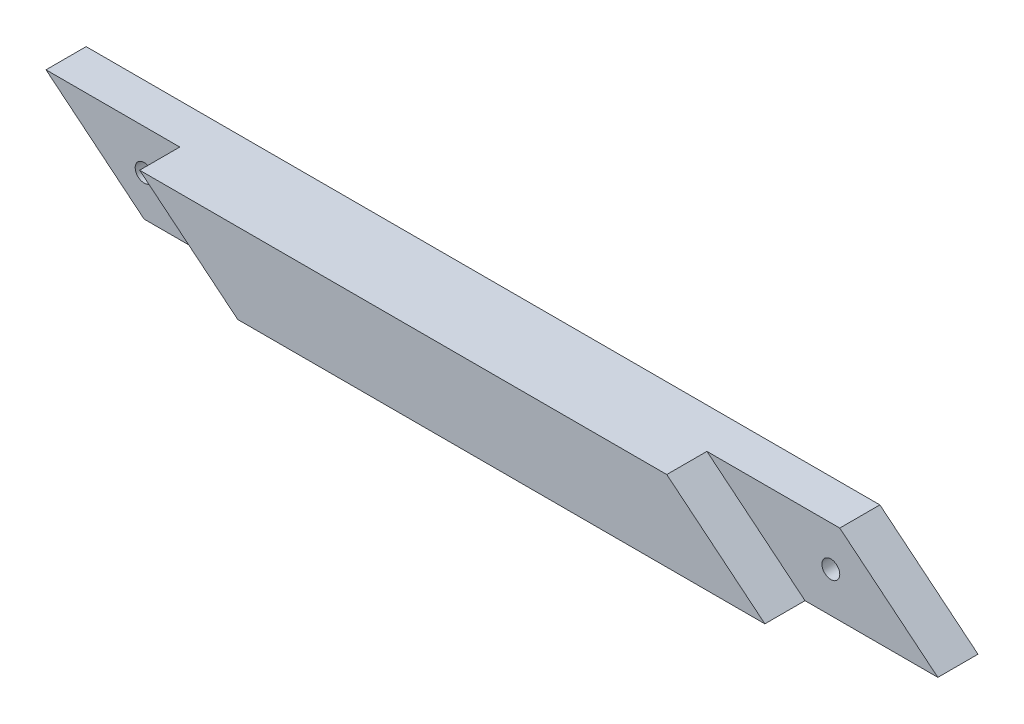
ISO-10303-21;
HEADER;
FILE_DESCRIPTION(('STEP AP214'),'2;1');
FILE_NAME('part.step','',(''),(''),'','','');
FILE_SCHEMA(('AUTOMOTIVE_DESIGN { 1 0 10303 214 1 1 1 1 }'));
ENDSEC;
DATA;
#1=APPLICATION_CONTEXT('core data for automotive mechanical design processes');
#2=APPLICATION_PROTOCOL_DEFINITION('international standard','automotive_design',2000,#1);
#3=PRODUCT_CONTEXT('',#1,'mechanical');
#4=PRODUCT('Part','Part','',(#3));
#5=PRODUCT_RELATED_PRODUCT_CATEGORY('part','',(#4));
#6=PRODUCT_DEFINITION_FORMATION('','',#4);
#7=PRODUCT_DEFINITION_CONTEXT('part definition',#1,'design');
#8=PRODUCT_DEFINITION('design','',#6,#7);
#9=PRODUCT_DEFINITION_SHAPE('','',#8);
#10=(LENGTH_UNIT() NAMED_UNIT(*) SI_UNIT(.MILLI.,.METRE.));
#11=(NAMED_UNIT(*) PLANE_ANGLE_UNIT() SI_UNIT($,.RADIAN.));
#12=(NAMED_UNIT(*) SI_UNIT($,.STERADIAN.) SOLID_ANGLE_UNIT());
#13=UNCERTAINTY_MEASURE_WITH_UNIT(LENGTH_MEASURE(1.E-05),#10,'distance_accuracy_value','');
#14=(GEOMETRIC_REPRESENTATION_CONTEXT(3) GLOBAL_UNCERTAINTY_ASSIGNED_CONTEXT((#13)) GLOBAL_UNIT_ASSIGNED_CONTEXT((#10,
#11,#12)) REPRESENTATION_CONTEXT('',''));
#15=CARTESIAN_POINT('',(0.,0.,0.));
#16=DIRECTION('',(0.,0.,1.));
#17=DIRECTION('',(1.,0.,0.));
#18=AXIS2_PLACEMENT_3D('',#15,#16,#17);
#19=CARTESIAN_POINT('',(0.,0.,9.));
#20=DIRECTION('',(0.,1.,0.));
#21=DIRECTION('',(0.,0.,1.));
#22=AXIS2_PLACEMENT_3D('',#19,#20,#21);
#23=PLANE('',#22);
#24=DIRECTION('',(1.,0.,0.));
#25=VECTOR('',#24,1.);
#26=CARTESIAN_POINT('',(85.1045406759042,0.,4.5));
#27=LINE('',#26,#25);
#28=CARTESIAN_POINT('',(85.1045406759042,0.,4.5));
#29=VERTEX_POINT('',#28);
#30=CARTESIAN_POINT('',(100.,0.,4.5));
#31=VERTEX_POINT('',#30);
#32=EDGE_CURVE('E45',#29,#31,#27,.T.);
#33=ORIENTED_EDGE('',*,*,#32,.F.);
#34=DIRECTION('',(0.,0.,1.));
#35=VECTOR('',#34,1.);
#36=CARTESIAN_POINT('',(85.1045406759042,0.,4.5));
#37=LINE('',#36,#35);
#38=CARTESIAN_POINT('',(85.1045406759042,0.,9.));
#39=VERTEX_POINT('',#38);
#40=EDGE_CURVE('E121',#29,#39,#37,.T.);
#41=ORIENTED_EDGE('',*,*,#40,.T.);
#42=DIRECTION('',(1.,0.,0.));
#43=VECTOR('',#42,1.);
#44=CARTESIAN_POINT('',(0.,0.,9.));
#45=LINE('',#44,#43);
#46=CARTESIAN_POINT('',(26.,0.,9.));
#47=VERTEX_POINT('',#46);
#48=EDGE_CURVE('E150',#47,#39,#45,.T.);
#49=ORIENTED_EDGE('',*,*,#48,.F.);
#50=DIRECTION('',(0.,0.,1.));
#51=VECTOR('',#50,1.);
#52=CARTESIAN_POINT('',(26.,0.,4.5));
#53=LINE('',#52,#51);
#54=CARTESIAN_POINT('',(26.,0.,4.5));
#55=VERTEX_POINT('',#54);
#56=EDGE_CURVE('E136',#55,#47,#53,.T.);
#57=ORIENTED_EDGE('',*,*,#56,.F.);
#58=DIRECTION('',(1.,0.,0.));
#59=VECTOR('',#58,1.);
#60=CARTESIAN_POINT('',(26.,0.,4.5));
#61=LINE('',#60,#59);
#62=CARTESIAN_POINT('',(11.,0.,4.5));
#63=VERTEX_POINT('',#62);
#64=EDGE_CURVE('E130',#63,#55,#61,.T.);
#65=ORIENTED_EDGE('',*,*,#64,.F.);
#66=DIRECTION('',(0.,0.,1.));
#67=VECTOR('',#66,1.);
#68=CARTESIAN_POINT('',(11.,0.,0.));
#69=LINE('',#68,#67);
#70=CARTESIAN_POINT('',(11.,0.,0.));
#71=VERTEX_POINT('',#70);
#72=EDGE_CURVE('E146',#71,#63,#69,.T.);
#73=ORIENTED_EDGE('',*,*,#72,.F.);
#74=DIRECTION('',(1.,0.,0.));
#75=VECTOR('',#74,1.);
#76=CARTESIAN_POINT('',(0.,0.,0.));
#77=LINE('',#76,#75);
#78=CARTESIAN_POINT('',(100.,0.,0.));
#79=VERTEX_POINT('',#78);
#80=EDGE_CURVE('E149',#71,#79,#77,.T.);
#81=ORIENTED_EDGE('',*,*,#80,.T.);
#82=DIRECTION('',(0.,0.,-1.));
#83=VECTOR('',#82,1.);
#84=CARTESIAN_POINT('',(100.,0.,9.));
#85=LINE('',#84,#83);
#86=EDGE_CURVE('E11',#31,#79,#85,.T.);
#87=ORIENTED_EDGE('',*,*,#86,.F.);
#88=EDGE_LOOP('',(#33,#41,#49,#57,#65,#73,#81,#87));
#89=FACE_BOUND('',#88,.T.);
#90=ADVANCED_FACE('F31',(#89),#23,.F.);
#91=CARTESIAN_POINT('',(0.,9.,9.));
#92=DIRECTION('',(0.,-1.,0.));
#93=DIRECTION('',(0.,0.,-1.));
#94=AXIS2_PLACEMENT_3D('',#91,#92,#93);
#95=PLANE('',#94);
#96=DIRECTION('',(-1.,0.,0.));
#97=VECTOR('',#96,1.);
#98=CARTESIAN_POINT('',(0.,9.,9.));
#99=LINE('',#98,#97);
#100=CARTESIAN_POINT('',(74.1045406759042,9.,9.));
#101=VERTEX_POINT('',#100);
#102=CARTESIAN_POINT('',(15.,9.,9.));
#103=VERTEX_POINT('',#102);
#104=EDGE_CURVE('E153',#101,#103,#99,.T.);
#105=ORIENTED_EDGE('',*,*,#104,.F.);
#106=DIRECTION('',(0.,0.,1.));
#107=VECTOR('',#106,1.);
#108=CARTESIAN_POINT('',(74.1045406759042,9.,4.5));
#109=LINE('',#108,#107);
#110=CARTESIAN_POINT('',(74.1045406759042,9.,4.5));
#111=VERTEX_POINT('',#110);
#112=EDGE_CURVE('E110',#111,#101,#109,.T.);
#113=ORIENTED_EDGE('',*,*,#112,.F.);
#114=DIRECTION('',(-1.,0.,0.));
#115=VECTOR('',#114,1.);
#116=CARTESIAN_POINT('',(89.,9.,4.5));
#117=LINE('',#116,#115);
#118=CARTESIAN_POINT('',(89.,9.,4.5));
#119=VERTEX_POINT('',#118);
#120=EDGE_CURVE('E97',#119,#111,#117,.T.);
#121=ORIENTED_EDGE('',*,*,#120,.F.);
#122=DIRECTION('',(0.,0.,1.));
#123=VECTOR('',#122,1.);
#124=CARTESIAN_POINT('',(89.,9.,0.));
#125=LINE('',#124,#123);
#126=CARTESIAN_POINT('',(89.,9.,0.));
#127=VERTEX_POINT('',#126);
#128=EDGE_CURVE('E108',#127,#119,#125,.T.);
#129=ORIENTED_EDGE('',*,*,#128,.F.);
#130=DIRECTION('',(-1.,0.,0.));
#131=VECTOR('',#130,1.);
#132=CARTESIAN_POINT('',(0.,9.,0.));
#133=LINE('',#132,#131);
#134=CARTESIAN_POINT('',(0.,9.,0.));
#135=VERTEX_POINT('',#134);
#136=EDGE_CURVE('E154',#127,#135,#133,.T.);
#137=ORIENTED_EDGE('',*,*,#136,.T.);
#138=DIRECTION('',(0.,0.,-1.));
#139=VECTOR('',#138,1.);
#140=CARTESIAN_POINT('',(0.,9.,9.));
#141=LINE('',#140,#139);
#142=CARTESIAN_POINT('',(0.,9.,4.5));
#143=VERTEX_POINT('',#142);
#144=EDGE_CURVE('E38',#143,#135,#141,.T.);
#145=ORIENTED_EDGE('',*,*,#144,.F.);
#146=DIRECTION('',(-1.,0.,0.));
#147=VECTOR('',#146,1.);
#148=CARTESIAN_POINT('',(0.,9.,4.5));
#149=LINE('',#148,#147);
#150=CARTESIAN_POINT('',(15.,9.,4.5));
#151=VERTEX_POINT('',#150);
#152=EDGE_CURVE('E53',#151,#143,#149,.T.);
#153=ORIENTED_EDGE('',*,*,#152,.F.);
#154=DIRECTION('',(0.,0.,1.));
#155=VECTOR('',#154,1.);
#156=CARTESIAN_POINT('',(15.,9.,4.5));
#157=LINE('',#156,#155);
#158=EDGE_CURVE('E139',#151,#103,#157,.T.);
#159=ORIENTED_EDGE('',*,*,#158,.T.);
#160=EDGE_LOOP('',(#105,#113,#121,#129,#137,#145,#153,#159));
#161=FACE_BOUND('',#160,.T.);
#162=ADVANCED_FACE('F107',(#161),#95,.F.);
#163=CARTESIAN_POINT('',(0.,9.,9.));
#164=DIRECTION('',(0.,0.,-1.));
#165=DIRECTION('',(-1.,0.,0.));
#166=AXIS2_PLACEMENT_3D('',#163,#164,#165);
#167=PLANE('',#166);
#168=ORIENTED_EDGE('',*,*,#48,.T.);
#169=DIRECTION('',(0.773957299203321,-0.633237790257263,0.));
#170=VECTOR('',#169,1.);
#171=CARTESIAN_POINT('',(74.1045406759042,9.,9.));
#172=LINE('',#171,#170);
#173=EDGE_CURVE('E102',#101,#39,#172,.T.);
#174=ORIENTED_EDGE('',*,*,#173,.F.);
#175=ORIENTED_EDGE('',*,*,#104,.T.);
#176=DIRECTION('',(-0.773957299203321,0.633237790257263,0.));
#177=VECTOR('',#176,1.);
#178=CARTESIAN_POINT('',(15.,9.,9.));
#179=LINE('',#178,#177);
#180=EDGE_CURVE('E126',#47,#103,#179,.T.);
#181=ORIENTED_EDGE('',*,*,#180,.F.);
#182=EDGE_LOOP('',(#168,#174,#175,#181));
#183=FACE_BOUND('',#182,.T.);
#184=ADVANCED_FACE('F176',(#183),#167,.F.);
#185=CARTESIAN_POINT('',(0.,9.,0.));
#186=DIRECTION('',(0.,0.,-1.));
#187=DIRECTION('',(-1.,0.,0.));
#188=AXIS2_PLACEMENT_3D('',#185,#186,#187);
#189=PLANE('',#188);
#190=CARTESIAN_POINT('',(88.,4.5,0.));
#191=DIRECTION('',(0.,0.,1.));
#192=DIRECTION('',(1.,0.,0.));
#193=AXIS2_PLACEMENT_3D('',#190,#191,#192);
#194=CIRCLE('',#193,0.999999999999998);
#195=CARTESIAN_POINT('',(89.,4.5,0.));
#196=VERTEX_POINT('',#195);
#197=EDGE_CURVE('E183',#196,#196,#194,.T.);
#198=ORIENTED_EDGE('',*,*,#197,.T.);
#199=EDGE_LOOP('',(#198));
#200=FACE_BOUND('',#199,.T.);
#201=DIRECTION('',(0.773957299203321,-0.633237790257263,0.));
#202=VECTOR('',#201,1.);
#203=CARTESIAN_POINT('',(89.,9.,0.));
#204=LINE('',#203,#202);
#205=EDGE_CURVE('E115',#127,#79,#204,.T.);
#206=ORIENTED_EDGE('',*,*,#205,.T.);
#207=ORIENTED_EDGE('',*,*,#80,.F.);
#208=DIRECTION('',(-0.773957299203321,0.633237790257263,0.));
#209=VECTOR('',#208,1.);
#210=CARTESIAN_POINT('',(0.,9.,0.));
#211=LINE('',#210,#209);
#212=EDGE_CURVE('E142',#71,#135,#211,.T.);
#213=ORIENTED_EDGE('',*,*,#212,.T.);
#214=ORIENTED_EDGE('',*,*,#136,.F.);
#215=EDGE_LOOP('',(#206,#207,#213,#214));
#216=FACE_BOUND('',#215,.T.);
#217=CARTESIAN_POINT('',(11.,4.5,0.));
#218=DIRECTION('',(0.,0.,1.));
#219=DIRECTION('',(1.,0.,0.));
#220=AXIS2_PLACEMENT_3D('',#217,#218,#219);
#221=CIRCLE('',#220,1.);
#222=CARTESIAN_POINT('',(12.,4.5,0.));
#223=VERTEX_POINT('',#222);
#224=EDGE_CURVE('E119',#223,#223,#221,.T.);
#225=ORIENTED_EDGE('',*,*,#224,.T.);
#226=EDGE_LOOP('',(#225));
#227=FACE_BOUND('',#226,.T.);
#228=ADVANCED_FACE('F165',(#200,#216,#227),#189,.T.);
#229=CARTESIAN_POINT('',(0.,9.,0.));
#230=DIRECTION('',(0.633237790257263,0.773957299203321,0.));
#231=DIRECTION('',(-0.773957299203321,0.633237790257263,0.));
#232=AXIS2_PLACEMENT_3D('',#229,#230,#231);
#233=PLANE('',#232);
#234=ORIENTED_EDGE('',*,*,#72,.T.);
#235=DIRECTION('',(0.773957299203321,-0.633237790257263,0.));
#236=VECTOR('',#235,1.);
#237=CARTESIAN_POINT('',(11.,0.,4.5));
#238=LINE('',#237,#236);
#239=EDGE_CURVE('E128',#143,#63,#238,.T.);
#240=ORIENTED_EDGE('',*,*,#239,.F.);
#241=ORIENTED_EDGE('',*,*,#144,.T.);
#242=ORIENTED_EDGE('',*,*,#212,.F.);
#243=EDGE_LOOP('',(#234,#240,#241,#242));
#244=FACE_BOUND('',#243,.T.);
#245=ADVANCED_FACE('F161',(#244),#233,.F.);
#246=CARTESIAN_POINT('',(15.,9.,4.5));
#247=DIRECTION('',(0.633237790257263,0.773957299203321,0.));
#248=DIRECTION('',(-0.773957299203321,0.633237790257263,0.));
#249=AXIS2_PLACEMENT_3D('',#246,#247,#248);
#250=PLANE('',#249);
#251=ORIENTED_EDGE('',*,*,#180,.T.);
#252=ORIENTED_EDGE('',*,*,#158,.F.);
#253=DIRECTION('',(-0.773957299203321,0.633237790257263,0.));
#254=VECTOR('',#253,1.);
#255=CARTESIAN_POINT('',(15.,9.,4.5));
#256=LINE('',#255,#254);
#257=EDGE_CURVE('E133',#55,#151,#256,.T.);
#258=ORIENTED_EDGE('',*,*,#257,.F.);
#259=ORIENTED_EDGE('',*,*,#56,.T.);
#260=EDGE_LOOP('',(#251,#252,#258,#259));
#261=FACE_BOUND('',#260,.T.);
#262=ADVANCED_FACE('F173',(#261),#250,.F.);
#263=CARTESIAN_POINT('',(0.,9.,4.5));
#264=DIRECTION('',(0.,0.,-1.));
#265=DIRECTION('',(-1.,0.,0.));
#266=AXIS2_PLACEMENT_3D('',#263,#264,#265);
#267=PLANE('',#266);
#268=CARTESIAN_POINT('',(11.,4.5,4.5));
#269=DIRECTION('',(0.,0.,1.));
#270=DIRECTION('',(1.,0.,0.));
#271=AXIS2_PLACEMENT_3D('',#268,#269,#270);
#272=CIRCLE('',#271,1.);
#273=CARTESIAN_POINT('',(12.,4.5,4.5));
#274=VERTEX_POINT('',#273);
#275=EDGE_CURVE('E116',#274,#274,#272,.T.);
#276=ORIENTED_EDGE('',*,*,#275,.F.);
#277=EDGE_LOOP('',(#276));
#278=FACE_BOUND('',#277,.T.);
#279=ORIENTED_EDGE('',*,*,#239,.T.);
#280=ORIENTED_EDGE('',*,*,#64,.T.);
#281=ORIENTED_EDGE('',*,*,#257,.T.);
#282=ORIENTED_EDGE('',*,*,#152,.T.);
#283=EDGE_LOOP('',(#279,#280,#281,#282));
#284=FACE_BOUND('',#283,.T.);
#285=ADVANCED_FACE('F171',(#278,#284),#267,.F.);
#286=CARTESIAN_POINT('',(11.,4.5,0.));
#287=DIRECTION('',(0.,0.,1.));
#288=DIRECTION('',(1.,0.,0.));
#289=AXIS2_PLACEMENT_3D('',#286,#287,#288);
#290=CYLINDRICAL_SURFACE('',#289,1.);
#291=ORIENTED_EDGE('',*,*,#224,.F.);
#292=EDGE_LOOP('',(#291));
#293=FACE_BOUND('',#292,.T.);
#294=ORIENTED_EDGE('',*,*,#275,.T.);
#295=EDGE_LOOP('',(#294));
#296=FACE_BOUND('',#295,.T.);
#297=ADVANCED_FACE('F223',(#293,#296),#290,.F.);
#298=CARTESIAN_POINT('',(89.,9.,0.));
#299=DIRECTION('',(-0.633237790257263,-0.773957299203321,0.));
#300=DIRECTION('',(0.773957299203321,-0.633237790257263,0.));
#301=AXIS2_PLACEMENT_3D('',#298,#299,#300);
#302=PLANE('',#301);
#303=ORIENTED_EDGE('',*,*,#128,.T.);
#304=DIRECTION('',(-0.773957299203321,0.633237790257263,0.));
#305=VECTOR('',#304,1.);
#306=CARTESIAN_POINT('',(100.,0.,4.5));
#307=LINE('',#306,#305);
#308=EDGE_CURVE('E94',#31,#119,#307,.T.);
#309=ORIENTED_EDGE('',*,*,#308,.F.);
#310=ORIENTED_EDGE('',*,*,#86,.T.);
#311=ORIENTED_EDGE('',*,*,#205,.F.);
#312=EDGE_LOOP('',(#303,#309,#310,#311));
#313=FACE_BOUND('',#312,.T.);
#314=ADVANCED_FACE('F113',(#313),#302,.F.);
#315=CARTESIAN_POINT('',(74.1045406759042,9.,4.5));
#316=DIRECTION('',(-0.633237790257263,-0.773957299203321,0.));
#317=DIRECTION('',(0.773957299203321,-0.633237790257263,0.));
#318=AXIS2_PLACEMENT_3D('',#315,#316,#317);
#319=PLANE('',#318);
#320=ORIENTED_EDGE('',*,*,#173,.T.);
#321=ORIENTED_EDGE('',*,*,#40,.F.);
#322=DIRECTION('',(0.773957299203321,-0.633237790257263,0.));
#323=VECTOR('',#322,1.);
#324=CARTESIAN_POINT('',(74.1045406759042,9.,4.5));
#325=LINE('',#324,#323);
#326=EDGE_CURVE('E111',#111,#29,#325,.T.);
#327=ORIENTED_EDGE('',*,*,#326,.F.);
#328=ORIENTED_EDGE('',*,*,#112,.T.);
#329=EDGE_LOOP('',(#320,#321,#327,#328));
#330=FACE_BOUND('',#329,.T.);
#331=ADVANCED_FACE('F200',(#330),#319,.F.);
#332=CARTESIAN_POINT('',(100.,0.,4.5));
#333=DIRECTION('',(0.,0.,-1.));
#334=DIRECTION('',(-1.,0.,0.));
#335=AXIS2_PLACEMENT_3D('',#332,#333,#334);
#336=PLANE('',#335);
#337=CARTESIAN_POINT('',(88.,4.5,4.5));
#338=DIRECTION('',(0.,0.,1.));
#339=DIRECTION('',(1.,0.,0.));
#340=AXIS2_PLACEMENT_3D('',#337,#338,#339);
#341=CIRCLE('',#340,0.999999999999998);
#342=CARTESIAN_POINT('',(89.,4.5,4.5));
#343=VERTEX_POINT('',#342);
#344=EDGE_CURVE('E186',#343,#343,#341,.T.);
#345=ORIENTED_EDGE('',*,*,#344,.F.);
#346=EDGE_LOOP('',(#345));
#347=FACE_BOUND('',#346,.T.);
#348=ORIENTED_EDGE('',*,*,#308,.T.);
#349=ORIENTED_EDGE('',*,*,#120,.T.);
#350=ORIENTED_EDGE('',*,*,#326,.T.);
#351=ORIENTED_EDGE('',*,*,#32,.T.);
#352=EDGE_LOOP('',(#348,#349,#350,#351));
#353=FACE_BOUND('',#352,.T.);
#354=ADVANCED_FACE('F96',(#347,#353),#336,.F.);
#355=CARTESIAN_POINT('',(88.,4.5,0.));
#356=DIRECTION('',(0.,0.,1.));
#357=DIRECTION('',(1.,0.,0.));
#358=AXIS2_PLACEMENT_3D('',#355,#356,#357);
#359=CYLINDRICAL_SURFACE('',#358,0.999999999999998);
#360=ORIENTED_EDGE('',*,*,#197,.F.);
#361=EDGE_LOOP('',(#360));
#362=FACE_BOUND('',#361,.T.);
#363=ORIENTED_EDGE('',*,*,#344,.T.);
#364=EDGE_LOOP('',(#363));
#365=FACE_BOUND('',#364,.T.);
#366=ADVANCED_FACE('F193',(#362,#365),#359,.F.);
#367=CLOSED_SHELL('',(#90,#162,#184,#228,#245,#262,#285,#297,#314,#331,#354,#366));
#368=MANIFOLD_SOLID_BREP('B2',#367);
#369=ADVANCED_BREP_SHAPE_REPRESENTATION('',(#18,#368),#14);
#370=SHAPE_DEFINITION_REPRESENTATION(#9,#369);
ENDSEC;
END-ISO-10303-21;
